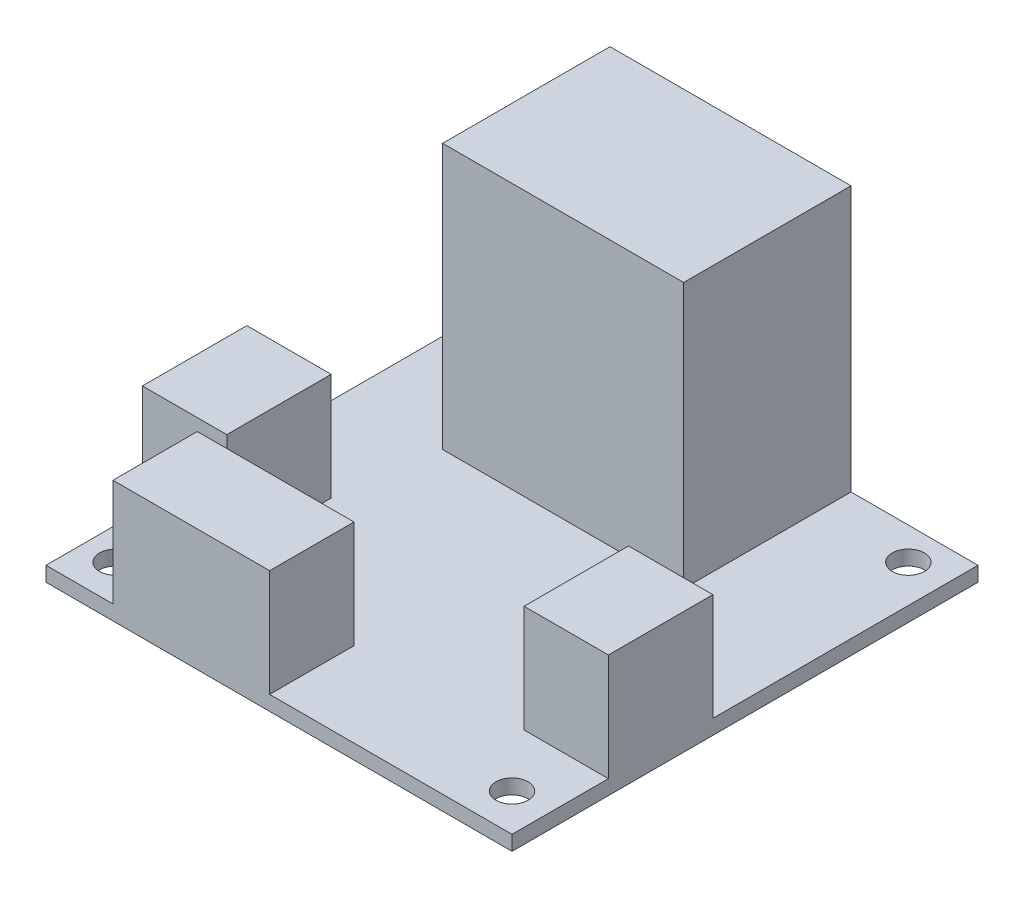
from build123d import *

# Parameters (mm, degrees)
SKETCH1_W           = 44.196
SKETCH1_H           = 44.196
SKETCH1_R           = 1.524
BOSS_EXTRUDE1_DEPTH = 1.397
SKETCH2_W           = 22.86
SKETCH2_H           = 15.875
BOSS_EXTRUDE2_DEPTH = 25.146
SKETCH3_W           = 8.001
SKETCH3_H           = 9.906
SKETCH3_W_2         = 14.859
SKETCH3_H_2         = 8.001
BOSS_EXTRUDE3_DEPTH = 10.16


with BuildPart() as part:
    # Sketch1 → Boss-Extrude1 (new body)
    with BuildSketch(Plane(origin=(0, 0, 0), x_dir=(1, 0, 0), z_dir=(0, 1, 0))):
        with Locations((22.098, 22.098)):
            Rectangle(SKETCH1_W, SKETCH1_H)
        with Locations(Location((3.048, 41.148, 0), (0, 0, 270))):
            Circle(SKETCH1_R, mode=Mode.SUBTRACT)
        with Locations(Location((40.64, 41.148, 0), (0, 0, 270))):
            Circle(SKETCH1_R, mode=Mode.SUBTRACT)
        with Locations(Location((40.64, 3.556, 0), (0, 0, 270))):
            Circle(SKETCH1_R, mode=Mode.SUBTRACT)
        with Locations(Location((3.048, 3.556, 0), (0, 0, 270))):
            Circle(SKETCH1_R, mode=Mode.SUBTRACT)
    extrude(amount=BOSS_EXTRUDE1_DEPTH)

    # Sketch2 → Boss-Extrude2 (add)
    with BuildSketch(Plane(origin=(0, 1.397, 0), x_dir=(1, 0, 0), z_dir=(0, 1, 0))):
        with Locations((20.725296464, 36.2585)):
            Rectangle(SKETCH2_W, SKETCH2_H)
    extrude(amount=BOSS_EXTRUDE2_DEPTH)

    # Sketch3 → Boss-Extrude3 (add)
    with BuildSketch(Plane(origin=(0, 1.397, 0), x_dir=(1, 0, 0), z_dir=(0, 1, 0))):
        with Locations((4.0005, 14.097)):
            Rectangle(SKETCH3_W, SKETCH3_H)
        with Locations((13.7795, 4.0005)):
            Rectangle(SKETCH3_W_2, SKETCH3_H_2)
        with Locations((40.1955, 14.097)):
            Rectangle(SKETCH3_W, SKETCH3_H)
    extrude(amount=BOSS_EXTRUDE3_DEPTH)


solid = part.part
